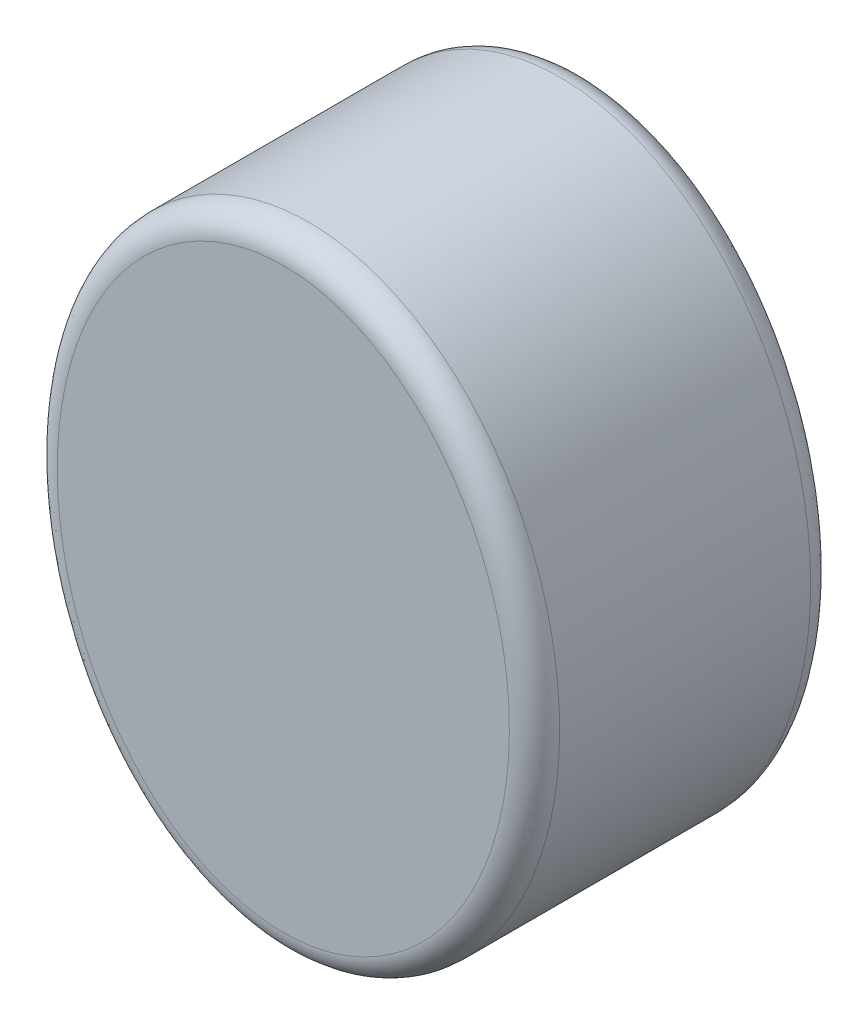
from build123d import *

# Parameters (mm, degrees)
ESQUISSE1_RX       = 12.5
ESQUISSE1_RY       = 10
BOSS_EXTRU_1_DEPTH = 12
CONG_1_R           = 1


with BuildPart() as part:
    # Esquisse1 → Boss.-Extru.1 (new body)
    with BuildSketch(Plane.XY):
        with Locations(Location((0, 0), (0, 0, -90))):
            Ellipse(ESQUISSE1_RX, ESQUISSE1_RY)
    extrude(amount=BOSS_EXTRU_1_DEPTH)

    # Cong_1
    cong_1_edges = [part.edges().sort_by_distance(p)[0] for p in [
        (-0.001564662, 12.499999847, 0),
        (-0.001564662, 12.499999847, 12),
    ]]
    fillet(cong_1_edges, radius=CONG_1_R)


solid = part.part
